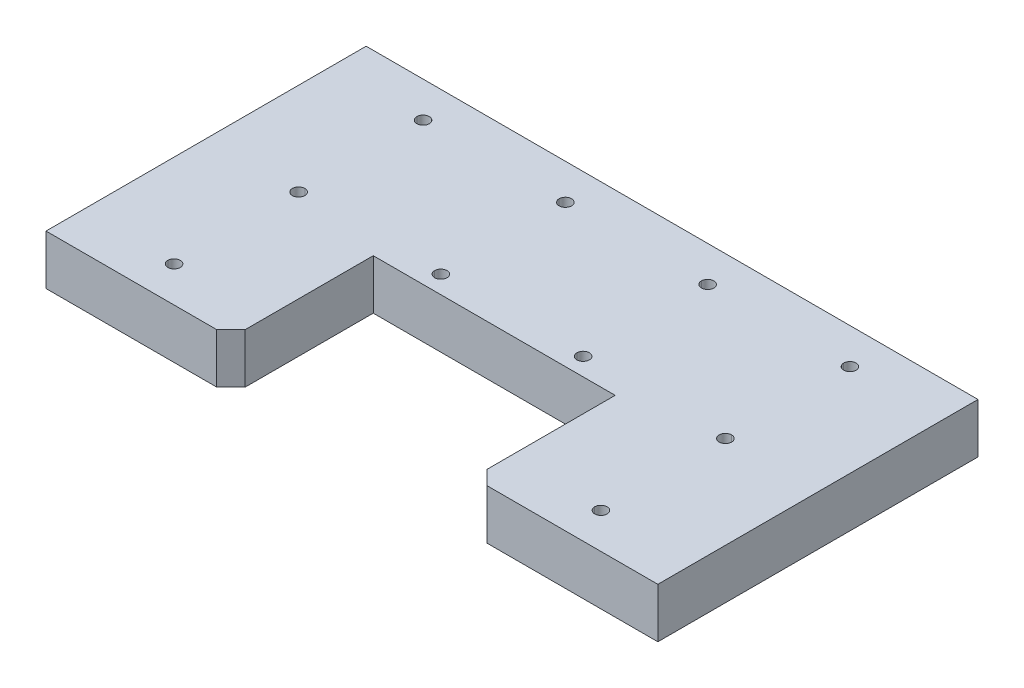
ISO-10303-21;
HEADER;
FILE_DESCRIPTION(('STEP AP214'),'2;1');
FILE_NAME('part.step','',(''),(''),'','','');
FILE_SCHEMA(('AUTOMOTIVE_DESIGN { 1 0 10303 214 1 1 1 1 }'));
ENDSEC;
DATA;
#1=APPLICATION_CONTEXT('core data for automotive mechanical design processes');
#2=APPLICATION_PROTOCOL_DEFINITION('international standard','automotive_design',2000,#1);
#3=PRODUCT_CONTEXT('',#1,'mechanical');
#4=PRODUCT('Part','Part','',(#3));
#5=PRODUCT_RELATED_PRODUCT_CATEGORY('part','',(#4));
#6=PRODUCT_DEFINITION_FORMATION('','',#4);
#7=PRODUCT_DEFINITION_CONTEXT('part definition',#1,'design');
#8=PRODUCT_DEFINITION('design','',#6,#7);
#9=PRODUCT_DEFINITION_SHAPE('','',#8);
#10=(LENGTH_UNIT() NAMED_UNIT(*) SI_UNIT(.MILLI.,.METRE.));
#11=(NAMED_UNIT(*) PLANE_ANGLE_UNIT() SI_UNIT($,.RADIAN.));
#12=(NAMED_UNIT(*) SI_UNIT($,.STERADIAN.) SOLID_ANGLE_UNIT());
#13=UNCERTAINTY_MEASURE_WITH_UNIT(LENGTH_MEASURE(1.E-05),#10,'distance_accuracy_value','');
#14=(GEOMETRIC_REPRESENTATION_CONTEXT(3) GLOBAL_UNCERTAINTY_ASSIGNED_CONTEXT((#13)) GLOBAL_UNIT_ASSIGNED_CONTEXT((#10,
#11,#12)) REPRESENTATION_CONTEXT('',''));
#15=CARTESIAN_POINT('',(0.,0.,0.));
#16=DIRECTION('',(0.,0.,1.));
#17=DIRECTION('',(1.,0.,0.));
#18=AXIS2_PLACEMENT_3D('',#15,#16,#17);
#19=CARTESIAN_POINT('',(130.005274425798,-0.000271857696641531,-46.4500657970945));
#20=DIRECTION('',(-2.09112818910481E-06,-0.999999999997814,0.));
#21=DIRECTION('',(0.999999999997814,-2.09112818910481E-06,0.));
#22=AXIS2_PLACEMENT_3D('',#19,#20,#21);
#23=PLANE('',#22);
#24=DIRECTION('',(0.999999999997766,-2.09112818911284E-06,-3.09362309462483E-07));
#25=VECTOR('',#24,1.);
#26=CARTESIAN_POINT('',(130.005163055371,-0.00027185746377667,-226.45006579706));
#27=LINE('',#26,#25);
#28=CARTESIAN_POINT('',(130.005163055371,-0.000271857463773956,-226.45006579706));
#29=VERTEX_POINT('',#28);
#30=CARTESIAN_POINT('',(470.005163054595,-0.000982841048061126,-226.450170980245));
#31=VERTEX_POINT('',#30);
#32=EDGE_CURVE('E379',#29,#31,#27,.T.);
#33=ORIENTED_EDGE('',*,*,#32,.F.);
#34=DIRECTION('',(6.18724598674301E-07,-1.29383244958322E-12,0.999999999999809));
#35=VECTOR('',#34,1.);
#36=CARTESIAN_POINT('',(130.005274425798,-0.000271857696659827,-46.4500657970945));
#37=LINE('',#36,#35);
#38=CARTESIAN_POINT('',(130.005274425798,-0.000271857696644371,-46.4500657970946));
#39=VERTEX_POINT('',#38);
#40=EDGE_CURVE('E374',#39,#29,#37,.F.);
#41=ORIENTED_EDGE('',*,*,#40,.F.);
#42=DIRECTION('',(0.707106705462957,-1.47865076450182E-06,-0.707106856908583));
#43=VECTOR('',#42,1.);
#44=CARTESIAN_POINT('',(110.005286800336,-0.000230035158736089,-26.4500738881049));
#45=LINE('',#44,#43);
#46=CARTESIAN_POINT('',(110.005286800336,-0.000230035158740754,-26.4500738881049));
#47=VERTEX_POINT('',#46);
#48=EDGE_CURVE('E368',#47,#39,#45,.T.);
#49=ORIENTED_EDGE('',*,*,#48,.F.);
#50=DIRECTION('',(0.999999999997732,-2.09112818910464E-06,4.04550324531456E-07));
#51=VECTOR('',#50,1.);
#52=CARTESIAN_POINT('',(-129.994836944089,0.000271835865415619,-26.4501709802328));
#53=LINE('',#52,#51);
#54=CARTESIAN_POINT('',(-129.994836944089,0.000271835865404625,-26.4501709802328));
#55=VERTEX_POINT('',#54);
#56=EDGE_CURVE('E284',#55,#47,#53,.T.);
#57=ORIENTED_EDGE('',*,*,#56,.F.);
#58=DIRECTION('',(0.,0.,1.));
#59=VECTOR('',#58,1.);
#60=CARTESIAN_POINT('',(-129.99483694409,0.000271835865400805,-26.4501709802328));
#61=LINE('',#60,#59);
#62=CARTESIAN_POINT('',(-129.994836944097,0.000271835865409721,-476.450170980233));
#63=VERTEX_POINT('',#62);
#64=EDGE_CURVE('E410',#63,#55,#61,.T.);
#65=ORIENTED_EDGE('',*,*,#64,.F.);
#66=DIRECTION('',(-0.999999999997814,2.09112818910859E-06,0.));
#67=VECTOR('',#66,1.);
#68=CARTESIAN_POINT('',(730.005163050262,-0.00152653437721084,-476.450170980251));
#69=LINE('',#68,#67);
#70=CARTESIAN_POINT('',(730.005163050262,-0.00152653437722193,-476.450170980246));
#71=VERTEX_POINT('',#70);
#72=EDGE_CURVE('E405',#71,#63,#69,.T.);
#73=ORIENTED_EDGE('',*,*,#72,.F.);
#74=DIRECTION('',(0.,0.,1.));
#75=VECTOR('',#74,1.);
#76=CARTESIAN_POINT('',(730.005163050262,-0.00152653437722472,-476.450170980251));
#77=LINE('',#76,#75);
#78=CARTESIAN_POINT('',(730.005163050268,-0.00152653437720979,-26.450170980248));
#79=VERTEX_POINT('',#78);
#80=EDGE_CURVE('E400',#79,#71,#77,.F.);
#81=ORIENTED_EDGE('',*,*,#80,.F.);
#82=DIRECTION('',(0.999999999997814,-2.09112818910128E-06,0.));
#83=VECTOR('',#82,1.);
#84=CARTESIAN_POINT('',(490.005163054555,-0.0010246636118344,-26.4501709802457));
#85=LINE('',#84,#83);
#86=CARTESIAN_POINT('',(490.005163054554,-0.00102466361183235,-26.4501709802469));
#87=VERTEX_POINT('',#86);
#88=EDGE_CURVE('E395',#87,#79,#85,.T.);
#89=ORIENTED_EDGE('',*,*,#88,.F.);
#90=DIRECTION('',(0.707106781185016,-1.47865092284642E-06,0.707106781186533));
#91=VECTOR('',#90,1.);
#92=CARTESIAN_POINT('',(470.005163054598,-0.000982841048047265,-46.4501709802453));
#93=LINE('',#92,#91);
#94=CARTESIAN_POINT('',(470.005163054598,-0.000982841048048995,-46.4501709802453));
#95=VERTEX_POINT('',#94);
#96=EDGE_CURVE('E387',#95,#87,#93,.T.);
#97=ORIENTED_EDGE('',*,*,#96,.F.);
#98=DIRECTION('',(0.,0.,1.));
#99=VECTOR('',#98,1.);
#100=CARTESIAN_POINT('',(470.005163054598,-0.000982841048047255,-46.4501709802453));
#101=LINE('',#100,#99);
#102=EDGE_CURVE('E384',#31,#95,#101,.T.);
#103=ORIENTED_EDGE('',*,*,#102,.F.);
#104=EDGE_LOOP('',(#33,#41,#49,#57,#65,#73,#81,#89,#97,#103));
#105=FACE_BOUND('',#104,.T.);
#106=CARTESIAN_POINT('',(400.005163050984,-0.00083646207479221,-426.450170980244));
#107=DIRECTION('',(2.09112818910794E-06,0.999999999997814,0.));
#108=DIRECTION('',(-0.999999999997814,2.09112818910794E-06,0.));
#109=AXIS2_PLACEMENT_3D('',#106,#107,#108);
#110=CIRCLE('',#109,8.75);
#111=CARTESIAN_POINT('',(408.755163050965,-0.000854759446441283,-426.450170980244));
#112=VERTEX_POINT('',#111);
#113=CARTESIAN_POINT('',(391.255163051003,-0.000818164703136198,-426.450170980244));
#114=VERTEX_POINT('',#113);
#115=EDGE_CURVE('E276',#112,#114,#110,.T.);
#116=ORIENTED_EDGE('',*,*,#115,.T.);
#117=CARTESIAN_POINT('',(400.005163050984,-0.000836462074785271,-426.450170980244));
#118=DIRECTION('',(2.09112818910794E-06,0.999999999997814,0.));
#119=DIRECTION('',(-0.999999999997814,2.09112818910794E-06,0.));
#120=AXIS2_PLACEMENT_3D('',#117,#118,#119);
#121=CIRCLE('',#120,8.75);
#122=EDGE_CURVE('E278',#114,#112,#121,.T.);
#123=ORIENTED_EDGE('',*,*,#122,.T.);
#124=EDGE_LOOP('',(#116,#123));
#125=FACE_BOUND('',#124,.T.);
#126=CARTESIAN_POINT('',(400.005163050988,-0.000836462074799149,-251.450170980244));
#127=DIRECTION('',(2.09112818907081E-06,0.999999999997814,0.));
#128=DIRECTION('',(-0.999999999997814,2.09112818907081E-06,0.));
#129=AXIS2_PLACEMENT_3D('',#126,#127,#128);
#130=CIRCLE('',#129,8.75);
#131=CARTESIAN_POINT('',(391.255163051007,-0.000818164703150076,-251.450170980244));
#132=VERTEX_POINT('',#131);
#133=CARTESIAN_POINT('',(408.755163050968,-0.000854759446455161,-251.450173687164));
#134=VERTEX_POINT('',#133);
#135=EDGE_CURVE('E270',#132,#134,#130,.T.);
#136=ORIENTED_EDGE('',*,*,#135,.T.);
#137=CARTESIAN_POINT('',(400.005163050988,-0.000836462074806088,-251.450170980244));
#138=DIRECTION('',(2.09112818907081E-06,0.999999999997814,0.));
#139=DIRECTION('',(-0.999999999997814,2.09112818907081E-06,0.));
#140=AXIS2_PLACEMENT_3D('',#137,#138,#139);
#141=CIRCLE('',#140,8.75);
#142=EDGE_CURVE('E272',#134,#132,#141,.T.);
#143=ORIENTED_EDGE('',*,*,#142,.T.);
#144=EDGE_LOOP('',(#136,#143));
#145=FACE_BOUND('',#144,.T.);
#146=CARTESIAN_POINT('',(600.00516305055,-0.00125468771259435,-251.450170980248));
#147=DIRECTION('',(2.09112818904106E-06,0.999999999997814,0.));
#148=DIRECTION('',(-0.999999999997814,2.09112818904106E-06,0.));
#149=AXIS2_PLACEMENT_3D('',#146,#147,#148);
#150=CIRCLE('',#149,8.75);
#151=CARTESIAN_POINT('',(600.00516305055,-0.00125468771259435,-242.700170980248));
#152=VERTEX_POINT('',#151);
#153=CARTESIAN_POINT('',(600.00516305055,-0.00125468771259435,-260.200170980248));
#154=VERTEX_POINT('',#153);
#155=EDGE_CURVE('E264',#152,#154,#150,.T.);
#156=ORIENTED_EDGE('',*,*,#155,.T.);
#157=CARTESIAN_POINT('',(600.00516305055,-0.00125468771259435,-251.450170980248));
#158=DIRECTION('',(2.09112818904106E-06,0.999999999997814,0.));
#159=DIRECTION('',(-0.999999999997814,2.09112818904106E-06,0.));
#160=AXIS2_PLACEMENT_3D('',#157,#158,#159);
#161=CIRCLE('',#160,8.75);
#162=EDGE_CURVE('E266',#154,#152,#161,.T.);
#163=ORIENTED_EDGE('',*,*,#162,.T.);
#164=EDGE_LOOP('',(#156,#163));
#165=FACE_BOUND('',#164,.T.);
#166=CARTESIAN_POINT('',(600.005163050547,-0.00125468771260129,-426.450170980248));
#167=DIRECTION('',(2.09112818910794E-06,0.999999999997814,0.));
#168=DIRECTION('',(-0.999999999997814,2.09112818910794E-06,0.));
#169=AXIS2_PLACEMENT_3D('',#166,#167,#168);
#170=CIRCLE('',#169,8.75);
#171=CARTESIAN_POINT('',(608.755163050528,-0.00127298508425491,-426.450170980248));
#172=VERTEX_POINT('',#171);
#173=CARTESIAN_POINT('',(591.255163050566,-0.00123639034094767,-426.450170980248));
#174=VERTEX_POINT('',#173);
#175=EDGE_CURVE('E258',#172,#174,#170,.T.);
#176=ORIENTED_EDGE('',*,*,#175,.T.);
#177=CARTESIAN_POINT('',(600.005163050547,-0.00125468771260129,-426.450170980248));
#178=DIRECTION('',(2.09112818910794E-06,0.999999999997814,0.));
#179=DIRECTION('',(-0.999999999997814,2.09112818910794E-06,0.));
#180=AXIS2_PLACEMENT_3D('',#177,#178,#179);
#181=CIRCLE('',#180,8.75);
#182=EDGE_CURVE('E260',#174,#172,#181,.T.);
#183=ORIENTED_EDGE('',*,*,#182,.T.);
#184=EDGE_LOOP('',(#176,#183));
#185=FACE_BOUND('',#184,.T.);
#186=CARTESIAN_POINT('',(600.005163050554,-0.0012546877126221,-76.4501709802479));
#187=DIRECTION('',(2.09112818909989E-06,0.999999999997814,0.));
#188=DIRECTION('',(-0.999999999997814,2.09112818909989E-06,0.));
#189=AXIS2_PLACEMENT_3D('',#186,#187,#188);
#190=CIRCLE('',#189,8.75);
#191=CARTESIAN_POINT('',(591.255163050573,-0.00123639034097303,-76.4501709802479));
#192=VERTEX_POINT('',#191);
#193=CARTESIAN_POINT('',(608.755163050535,-0.00127298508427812,-76.4501709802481));
#194=VERTEX_POINT('',#193);
#195=EDGE_CURVE('E252',#192,#194,#190,.T.);
#196=ORIENTED_EDGE('',*,*,#195,.T.);
#197=CARTESIAN_POINT('',(600.005163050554,-0.00125468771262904,-76.4501709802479));
#198=DIRECTION('',(2.09112818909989E-06,0.999999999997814,0.));
#199=DIRECTION('',(-0.999999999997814,2.09112818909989E-06,0.));
#200=AXIS2_PLACEMENT_3D('',#197,#198,#199);
#201=CIRCLE('',#200,8.75);
#202=EDGE_CURVE('E254',#194,#192,#201,.T.);
#203=ORIENTED_EDGE('',*,*,#202,.T.);
#204=EDGE_LOOP('',(#196,#203));
#205=FACE_BOUND('',#204,.T.);
#206=CARTESIAN_POINT('',(200.005163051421,-0.000418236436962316,-426.45017098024));
#207=DIRECTION('',(2.09112818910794E-06,0.999999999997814,0.));
#208=DIRECTION('',(-0.999999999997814,2.09112818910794E-06,0.));
#209=AXIS2_PLACEMENT_3D('',#206,#207,#208);
#210=CIRCLE('',#209,8.75);
#211=CARTESIAN_POINT('',(208.755163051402,-0.000436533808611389,-426.45017098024));
#212=VERTEX_POINT('',#211);
#213=CARTESIAN_POINT('',(191.255163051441,-0.000399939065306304,-426.45017098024));
#214=VERTEX_POINT('',#213);
#215=EDGE_CURVE('E246',#212,#214,#210,.T.);
#216=ORIENTED_EDGE('',*,*,#215,.T.);
#217=CARTESIAN_POINT('',(200.005163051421,-0.000418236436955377,-426.45017098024));
#218=DIRECTION('',(2.09112818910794E-06,0.999999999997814,0.));
#219=DIRECTION('',(-0.999999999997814,2.09112818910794E-06,0.));
#220=AXIS2_PLACEMENT_3D('',#217,#218,#219);
#221=CIRCLE('',#220,8.75);
#222=EDGE_CURVE('E248',#214,#212,#221,.T.);
#223=ORIENTED_EDGE('',*,*,#222,.T.);
#224=EDGE_LOOP('',(#216,#223));
#225=FACE_BOUND('',#224,.T.);
#226=CARTESIAN_POINT('',(200.005163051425,-0.000418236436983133,-251.45017098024));
#227=DIRECTION('',(2.09112818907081E-06,0.999999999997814,0.));
#228=DIRECTION('',(-0.999999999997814,2.09112818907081E-06,0.));
#229=AXIS2_PLACEMENT_3D('',#226,#227,#228);
#230=CIRCLE('',#229,8.75);
#231=CARTESIAN_POINT('',(191.255163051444,-0.00039993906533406,-251.45017098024));
#232=VERTEX_POINT('',#231);
#233=CARTESIAN_POINT('',(208.755163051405,-0.000436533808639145,-251.45017368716));
#234=VERTEX_POINT('',#233);
#235=EDGE_CURVE('E240',#232,#234,#230,.T.);
#236=ORIENTED_EDGE('',*,*,#235,.T.);
#237=CARTESIAN_POINT('',(200.005163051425,-0.000418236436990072,-251.45017098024));
#238=DIRECTION('',(2.09112818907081E-06,0.999999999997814,0.));
#239=DIRECTION('',(-0.999999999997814,2.09112818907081E-06,0.));
#240=AXIS2_PLACEMENT_3D('',#237,#238,#239);
#241=CIRCLE('',#240,8.75);
#242=EDGE_CURVE('E242',#234,#232,#241,.T.);
#243=ORIENTED_EDGE('',*,*,#242,.T.);
#244=EDGE_LOOP('',(#236,#243));
#245=FACE_BOUND('',#244,.T.);
#246=CARTESIAN_POINT('',(0.00516305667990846,-1.07991532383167E-08,-426.450170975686));
#247=DIRECTION('',(2.09112818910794E-06,0.999999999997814,0.));
#248=DIRECTION('',(-0.999999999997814,2.09112818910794E-06,0.));
#249=AXIS2_PLACEMENT_3D('',#246,#247,#248);
#250=CIRCLE('',#249,8.75);
#251=CARTESIAN_POINT('',(8.75516305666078,-1.83081708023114E-05,-426.450170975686));
#252=VERTEX_POINT('',#251);
#253=CARTESIAN_POINT('',(-8.74483694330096,1.82865725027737E-05,-426.450170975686));
#254=VERTEX_POINT('',#253);
#255=EDGE_CURVE('E234',#252,#254,#250,.T.);
#256=ORIENTED_EDGE('',*,*,#255,.T.);
#257=CARTESIAN_POINT('',(0.00516305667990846,-1.07991462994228E-08,-426.450170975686));
#258=DIRECTION('',(2.09112818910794E-06,0.999999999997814,0.));
#259=DIRECTION('',(-0.999999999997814,2.09112818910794E-06,0.));
#260=AXIS2_PLACEMENT_3D('',#257,#258,#259);
#261=CIRCLE('',#260,8.75);
#262=EDGE_CURVE('E236',#254,#252,#261,.T.);
#263=ORIENTED_EDGE('',*,*,#262,.T.);
#264=EDGE_LOOP('',(#256,#263));
#265=FACE_BOUND('',#264,.T.);
#266=CARTESIAN_POINT('',(0.00516305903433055,-1.07991671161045E-08,-251.450170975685));
#267=DIRECTION('',(2.09112818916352E-06,0.999999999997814,0.));
#268=DIRECTION('',(-0.999999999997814,2.09112818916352E-06,0.));
#269=AXIS2_PLACEMENT_3D('',#266,#267,#268);
#270=CIRCLE('',#269,8.75);
#271=CARTESIAN_POINT('',(0.00516305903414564,-1.07991671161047E-08,-260.200170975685));
#272=VERTEX_POINT('',#271);
#273=CARTESIAN_POINT('',(0.00516305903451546,-1.07991671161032E-08,-242.700170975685));
#274=VERTEX_POINT('',#273);
#275=EDGE_CURVE('E224',#272,#274,#270,.T.);
#276=ORIENTED_EDGE('',*,*,#275,.T.);
#277=CARTESIAN_POINT('',(0.00516305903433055,-1.07991671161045E-08,-251.450170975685));
#278=DIRECTION('',(2.09112818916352E-06,0.999999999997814,0.));
#279=DIRECTION('',(-0.999999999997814,2.09112818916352E-06,0.));
#280=AXIS2_PLACEMENT_3D('',#277,#278,#279);
#281=CIRCLE('',#280,8.75);
#282=EDGE_CURVE('E231',#274,#272,#281,.T.);
#283=ORIENTED_EDGE('',*,*,#282,.T.);
#284=EDGE_LOOP('',(#276,#283));
#285=FACE_BOUND('',#284,.T.);
#286=CARTESIAN_POINT('',(0.00516306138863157,-1.07991809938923E-08,-76.4501709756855));
#287=DIRECTION('',(2.09112818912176E-06,0.999999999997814,0.));
#288=DIRECTION('',(-0.999999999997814,2.09112818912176E-06,0.));
#289=AXIS2_PLACEMENT_3D('',#286,#287,#288);
#290=CIRCLE('',#289,8.75);
#291=CARTESIAN_POINT('',(-8.74483693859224,1.82865724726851E-05,-76.4501709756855));
#292=VERTEX_POINT('',#291);
#293=CARTESIAN_POINT('',(8.75516306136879,-1.83081708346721E-05,-76.4501674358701));
#294=VERTEX_POINT('',#293);
#295=EDGE_CURVE('E20',#292,#294,#290,.T.);
#296=ORIENTED_EDGE('',*,*,#295,.T.);
#297=CARTESIAN_POINT('',(0.00516306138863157,-1.07991809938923E-08,-76.4501709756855));
#298=DIRECTION('',(2.09112818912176E-06,0.999999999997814,0.));
#299=DIRECTION('',(-0.999999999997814,2.09112818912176E-06,0.));
#300=AXIS2_PLACEMENT_3D('',#297,#298,#299);
#301=CIRCLE('',#300,8.75);
#302=EDGE_CURVE('E211',#294,#292,#301,.T.);
#303=ORIENTED_EDGE('',*,*,#302,.T.);
#304=EDGE_LOOP('',(#296,#303));
#305=FACE_BOUND('',#304,.T.);
#306=ADVANCED_FACE('F17',(#105,#125,#145,#165,#185,#205,#225,#245,#265,#285,#305),#23,.T.);
#307=CARTESIAN_POINT('',(0.00523468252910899,34.249999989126,-76.4501709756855));
#308=DIRECTION('',(2.09112818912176E-06,0.999999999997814,0.));
#309=DIRECTION('',(-0.999999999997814,2.09112818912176E-06,0.));
#310=AXIS2_PLACEMENT_3D('',#307,#308,#309);
#311=CYLINDRICAL_SURFACE('',#310,8.75);
#312=ORIENTED_EDGE('',*,*,#295,.F.);
#313=DIRECTION('',(2.09112818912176E-06,0.999999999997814,0.));
#314=VECTOR('',#313,1.);
#315=CARTESIAN_POINT('',(-8.74476531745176,34.2500182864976,-76.4501709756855));
#316=LINE('',#315,#314);
#317=CARTESIAN_POINT('',(-8.744690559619,70.0000182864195,-76.4501709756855));
#318=VERTEX_POINT('',#317);
#319=EDGE_CURVE('E225',#292,#318,#316,.T.);
#320=ORIENTED_EDGE('',*,*,#319,.T.);
#321=CARTESIAN_POINT('',(0.00530944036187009,69.9999999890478,-76.4501709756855));
#322=DIRECTION('',(2.09112818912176E-06,0.999999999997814,0.));
#323=DIRECTION('',(-0.999999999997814,2.09112818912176E-06,0.));
#324=AXIS2_PLACEMENT_3D('',#321,#322,#323);
#325=CIRCLE('',#324,8.75);
#326=CARTESIAN_POINT('',(8.75530944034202,69.9999816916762,-76.4501674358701));
#327=VERTEX_POINT('',#326);
#328=EDGE_CURVE('E220',#327,#318,#325,.F.);
#329=ORIENTED_EDGE('',*,*,#328,.F.);
#330=DIRECTION('',(2.09112818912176E-06,0.999999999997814,0.));
#331=VECTOR('',#330,1.);
#332=CARTESIAN_POINT('',(8.75523468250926,34.2499816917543,-76.4501674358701));
#333=LINE('',#332,#331);
#334=EDGE_CURVE('E217',#327,#294,#333,.F.);
#335=ORIENTED_EDGE('',*,*,#334,.T.);
#336=EDGE_LOOP('',(#312,#320,#329,#335));
#337=FACE_BOUND('',#336,.T.);
#338=ADVANCED_FACE('F218',(#337),#311,.F.);
#339=CARTESIAN_POINT('',(0.00523468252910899,34.249999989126,-76.4501709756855));
#340=DIRECTION('',(2.09112818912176E-06,0.999999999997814,0.));
#341=DIRECTION('',(-0.999999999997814,2.09112818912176E-06,0.));
#342=AXIS2_PLACEMENT_3D('',#339,#340,#341);
#343=CYLINDRICAL_SURFACE('',#342,8.75);
#344=CARTESIAN_POINT('',(0.00530944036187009,69.9999999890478,-76.4501709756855));
#345=DIRECTION('',(2.09112818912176E-06,0.999999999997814,0.));
#346=DIRECTION('',(-0.999999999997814,2.09112818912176E-06,0.));
#347=AXIS2_PLACEMENT_3D('',#344,#345,#346);
#348=CIRCLE('',#347,8.75);
#349=EDGE_CURVE('E283',#318,#327,#348,.F.);
#350=ORIENTED_EDGE('',*,*,#349,.F.);
#351=ORIENTED_EDGE('',*,*,#319,.F.);
#352=ORIENTED_EDGE('',*,*,#302,.F.);
#353=ORIENTED_EDGE('',*,*,#334,.F.);
#354=EDGE_LOOP('',(#350,#351,#352,#353));
#355=FACE_BOUND('',#354,.T.);
#356=ADVANCED_FACE('F227',(#355),#343,.F.);
#357=CARTESIAN_POINT('',(0.0052346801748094,34.249999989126,-251.450170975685));
#358=DIRECTION('',(2.09112818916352E-06,0.999999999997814,0.));
#359=DIRECTION('',(-0.999999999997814,2.09112818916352E-06,0.));
#360=AXIS2_PLACEMENT_3D('',#357,#358,#359);
#361=CYLINDRICAL_SURFACE('',#360,8.75);
#362=ORIENTED_EDGE('',*,*,#275,.F.);
#363=DIRECTION('',(2.09112818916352E-06,0.999999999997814,0.));
#364=VECTOR('',#363,1.);
#365=CARTESIAN_POINT('',(0.00523468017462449,34.249999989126,-260.200170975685));
#366=LINE('',#365,#364);
#367=CARTESIAN_POINT('',(0.00530943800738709,69.9999999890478,-260.200170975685));
#368=VERTEX_POINT('',#367);
#369=EDGE_CURVE('E233',#272,#368,#366,.T.);
#370=ORIENTED_EDGE('',*,*,#369,.T.);
#371=CARTESIAN_POINT('',(0.005309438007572,69.9999999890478,-251.450170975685));
#372=DIRECTION('',(2.09112818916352E-06,0.999999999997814,0.));
#373=DIRECTION('',(-0.999999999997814,2.09112818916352E-06,0.));
#374=AXIS2_PLACEMENT_3D('',#371,#372,#373);
#375=CIRCLE('',#374,8.75);
#376=CARTESIAN_POINT('',(0.00530943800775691,69.9999999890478,-242.700170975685));
#377=VERTEX_POINT('',#376);
#378=EDGE_CURVE('E286',#377,#368,#375,.F.);
#379=ORIENTED_EDGE('',*,*,#378,.F.);
#380=DIRECTION('',(2.09112818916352E-06,0.999999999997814,0.));
#381=VECTOR('',#380,1.);
#382=CARTESIAN_POINT('',(0.00523468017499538,34.249999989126,-242.700170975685));
#383=LINE('',#382,#381);
#384=EDGE_CURVE('E237',#377,#274,#383,.F.);
#385=ORIENTED_EDGE('',*,*,#384,.T.);
#386=EDGE_LOOP('',(#362,#370,#379,#385));
#387=FACE_BOUND('',#386,.T.);
#388=ADVANCED_FACE('F688',(#387),#361,.F.);
#389=CARTESIAN_POINT('',(0.0052346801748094,34.249999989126,-251.450170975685));
#390=DIRECTION('',(2.09112818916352E-06,0.999999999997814,0.));
#391=DIRECTION('',(-0.999999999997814,2.09112818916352E-06,0.));
#392=AXIS2_PLACEMENT_3D('',#389,#390,#391);
#393=CYLINDRICAL_SURFACE('',#392,8.75);
#394=CARTESIAN_POINT('',(0.005309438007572,69.9999999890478,-251.450170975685));
#395=DIRECTION('',(2.09112818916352E-06,0.999999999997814,0.));
#396=DIRECTION('',(-0.999999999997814,2.09112818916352E-06,0.));
#397=AXIS2_PLACEMENT_3D('',#394,#395,#396);
#398=CIRCLE('',#397,8.75);
#399=EDGE_CURVE('E289',#368,#377,#398,.F.);
#400=ORIENTED_EDGE('',*,*,#399,.F.);
#401=ORIENTED_EDGE('',*,*,#369,.F.);
#402=ORIENTED_EDGE('',*,*,#282,.F.);
#403=ORIENTED_EDGE('',*,*,#384,.F.);
#404=EDGE_LOOP('',(#400,#401,#402,#403));
#405=FACE_BOUND('',#404,.T.);
#406=ADVANCED_FACE('F680',(#405),#393,.F.);
#407=CARTESIAN_POINT('',(0.0052346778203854,34.249999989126,-426.450170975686));
#408=DIRECTION('',(2.09112818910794E-06,0.999999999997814,0.));
#409=DIRECTION('',(-0.999999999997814,2.09112818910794E-06,0.));
#410=AXIS2_PLACEMENT_3D('',#407,#408,#409);
#411=CYLINDRICAL_SURFACE('',#410,8.75);
#412=ORIENTED_EDGE('',*,*,#255,.F.);
#413=DIRECTION('',(2.09112818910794E-06,0.999999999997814,0.));
#414=VECTOR('',#413,1.);
#415=CARTESIAN_POINT('',(8.75523467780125,34.2499816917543,-426.450170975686));
#416=LINE('',#415,#414);
#417=CARTESIAN_POINT('',(8.75530943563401,69.9999816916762,-426.450170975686));
#418=VERTEX_POINT('',#417);
#419=EDGE_CURVE('E239',#252,#418,#416,.T.);
#420=ORIENTED_EDGE('',*,*,#419,.T.);
#421=CARTESIAN_POINT('',(0.00530943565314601,69.9999999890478,-426.450170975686));
#422=DIRECTION('',(2.09112818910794E-06,0.999999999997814,0.));
#423=DIRECTION('',(-0.999999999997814,2.09112818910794E-06,0.));
#424=AXIS2_PLACEMENT_3D('',#421,#422,#423);
#425=CIRCLE('',#424,8.75);
#426=CARTESIAN_POINT('',(-8.74469056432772,70.0000182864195,-426.450170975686));
#427=VERTEX_POINT('',#426);
#428=EDGE_CURVE('E292',#427,#418,#425,.F.);
#429=ORIENTED_EDGE('',*,*,#428,.F.);
#430=DIRECTION('',(2.09112818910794E-06,0.999999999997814,0.));
#431=VECTOR('',#430,1.);
#432=CARTESIAN_POINT('',(-8.74476532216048,34.2500182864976,-426.450170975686));
#433=LINE('',#432,#431);
#434=EDGE_CURVE('E243',#427,#254,#433,.F.);
#435=ORIENTED_EDGE('',*,*,#434,.T.);
#436=EDGE_LOOP('',(#412,#420,#429,#435));
#437=FACE_BOUND('',#436,.T.);
#438=ADVANCED_FACE('F672',(#437),#411,.F.);
#439=CARTESIAN_POINT('',(0.0052346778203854,34.249999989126,-426.450170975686));
#440=DIRECTION('',(2.09112818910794E-06,0.999999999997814,0.));
#441=DIRECTION('',(-0.999999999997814,2.09112818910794E-06,0.));
#442=AXIS2_PLACEMENT_3D('',#439,#440,#441);
#443=CYLINDRICAL_SURFACE('',#442,8.75);
#444=CARTESIAN_POINT('',(0.00530943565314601,69.9999999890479,-426.450170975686));
#445=DIRECTION('',(2.09112818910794E-06,0.999999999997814,0.));
#446=DIRECTION('',(-0.999999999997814,2.09112818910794E-06,0.));
#447=AXIS2_PLACEMENT_3D('',#444,#445,#446);
#448=CIRCLE('',#447,8.75);
#449=EDGE_CURVE('E295',#418,#427,#448,.F.);
#450=ORIENTED_EDGE('',*,*,#449,.F.);
#451=ORIENTED_EDGE('',*,*,#419,.F.);
#452=ORIENTED_EDGE('',*,*,#262,.F.);
#453=ORIENTED_EDGE('',*,*,#434,.F.);
#454=EDGE_LOOP('',(#450,#451,#452,#453));
#455=FACE_BOUND('',#454,.T.);
#456=ADVANCED_FACE('F664',(#455),#443,.F.);
#457=CARTESIAN_POINT('',(200.005234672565,34.2495817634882,-251.45017098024));
#458=DIRECTION('',(2.09112818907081E-06,0.999999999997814,0.));
#459=DIRECTION('',(-0.999999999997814,2.09112818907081E-06,0.));
#460=AXIS2_PLACEMENT_3D('',#457,#458,#459);
#461=CYLINDRICAL_SURFACE('',#460,8.75);
#462=ORIENTED_EDGE('',*,*,#235,.F.);
#463=DIRECTION('',(2.09112818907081E-06,0.999999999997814,0.));
#464=VECTOR('',#463,1.);
#465=CARTESIAN_POINT('',(191.255234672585,34.2496000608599,-251.45017098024));
#466=LINE('',#465,#464);
#467=CARTESIAN_POINT('',(191.255309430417,69.9996000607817,-251.45017098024));
#468=VERTEX_POINT('',#467);
#469=EDGE_CURVE('E245',#232,#468,#466,.T.);
#470=ORIENTED_EDGE('',*,*,#469,.T.);
#471=CARTESIAN_POINT('',(200.005309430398,69.99958176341,-251.45017098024));
#472=DIRECTION('',(2.09112818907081E-06,0.999999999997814,0.));
#473=DIRECTION('',(-0.999999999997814,2.09112818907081E-06,0.));
#474=AXIS2_PLACEMENT_3D('',#471,#472,#473);
#475=CIRCLE('',#474,8.75);
#476=CARTESIAN_POINT('',(208.755309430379,69.9995634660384,-251.45017368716));
#477=VERTEX_POINT('',#476);
#478=EDGE_CURVE('E298',#477,#468,#475,.F.);
#479=ORIENTED_EDGE('',*,*,#478,.F.);
#480=DIRECTION('',(2.09112818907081E-06,0.999999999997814,0.));
#481=VECTOR('',#480,1.);
#482=CARTESIAN_POINT('',(208.755234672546,34.2495634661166,-251.45017368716));
#483=LINE('',#482,#481);
#484=EDGE_CURVE('E249',#477,#234,#483,.F.);
#485=ORIENTED_EDGE('',*,*,#484,.T.);
#486=EDGE_LOOP('',(#462,#470,#479,#485));
#487=FACE_BOUND('',#486,.T.);
#488=ADVANCED_FACE('F656',(#487),#461,.F.);
#489=CARTESIAN_POINT('',(200.005234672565,34.2495817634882,-251.45017098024));
#490=DIRECTION('',(2.09112818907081E-06,0.999999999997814,0.));
#491=DIRECTION('',(-0.999999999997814,2.09112818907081E-06,0.));
#492=AXIS2_PLACEMENT_3D('',#489,#490,#491);
#493=CYLINDRICAL_SURFACE('',#492,8.75);
#494=CARTESIAN_POINT('',(200.005309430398,69.99958176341,-251.45017098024));
#495=DIRECTION('',(2.09112818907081E-06,0.999999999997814,0.));
#496=DIRECTION('',(-0.999999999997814,2.09112818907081E-06,0.));
#497=AXIS2_PLACEMENT_3D('',#494,#495,#496);
#498=CIRCLE('',#497,8.75);
#499=EDGE_CURVE('E301',#468,#477,#498,.F.);
#500=ORIENTED_EDGE('',*,*,#499,.F.);
#501=ORIENTED_EDGE('',*,*,#469,.F.);
#502=ORIENTED_EDGE('',*,*,#242,.F.);
#503=ORIENTED_EDGE('',*,*,#484,.F.);
#504=EDGE_LOOP('',(#500,#501,#502,#503));
#505=FACE_BOUND('',#504,.T.);
#506=ADVANCED_FACE('F648',(#505),#493,.F.);
#507=CARTESIAN_POINT('',(200.005234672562,34.2495817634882,-426.45017098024));
#508=DIRECTION('',(2.09112818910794E-06,0.999999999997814,0.));
#509=DIRECTION('',(-0.999999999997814,2.09112818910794E-06,0.));
#510=AXIS2_PLACEMENT_3D('',#507,#508,#509);
#511=CYLINDRICAL_SURFACE('',#510,8.75);
#512=ORIENTED_EDGE('',*,*,#215,.F.);
#513=DIRECTION('',(2.09112818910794E-06,0.999999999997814,0.));
#514=VECTOR('',#513,1.);
#515=CARTESIAN_POINT('',(208.755234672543,34.2495634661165,-426.45017098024));
#516=LINE('',#515,#514);
#517=CARTESIAN_POINT('',(208.755309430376,69.9995634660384,-426.45017098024));
#518=VERTEX_POINT('',#517);
#519=EDGE_CURVE('E251',#212,#518,#516,.T.);
#520=ORIENTED_EDGE('',*,*,#519,.T.);
#521=CARTESIAN_POINT('',(200.005309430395,69.99958176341,-426.45017098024));
#522=DIRECTION('',(2.09112818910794E-06,0.999999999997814,0.));
#523=DIRECTION('',(-0.999999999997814,2.09112818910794E-06,0.));
#524=AXIS2_PLACEMENT_3D('',#521,#522,#523);
#525=CIRCLE('',#524,8.75);
#526=CARTESIAN_POINT('',(191.255309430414,69.9996000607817,-426.45017098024));
#527=VERTEX_POINT('',#526);
#528=EDGE_CURVE('E304',#527,#518,#525,.F.);
#529=ORIENTED_EDGE('',*,*,#528,.F.);
#530=DIRECTION('',(2.09112818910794E-06,0.999999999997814,0.));
#531=VECTOR('',#530,1.);
#532=CARTESIAN_POINT('',(191.255234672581,34.2496000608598,-426.45017098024));
#533=LINE('',#532,#531);
#534=EDGE_CURVE('E255',#527,#214,#533,.F.);
#535=ORIENTED_EDGE('',*,*,#534,.T.);
#536=EDGE_LOOP('',(#512,#520,#529,#535));
#537=FACE_BOUND('',#536,.T.);
#538=ADVANCED_FACE('F640',(#537),#511,.F.);
#539=CARTESIAN_POINT('',(200.005234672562,34.2495817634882,-426.45017098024));
#540=DIRECTION('',(2.09112818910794E-06,0.999999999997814,0.));
#541=DIRECTION('',(-0.999999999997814,2.09112818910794E-06,0.));
#542=AXIS2_PLACEMENT_3D('',#539,#540,#541);
#543=CYLINDRICAL_SURFACE('',#542,8.75);
#544=CARTESIAN_POINT('',(200.005309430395,69.99958176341,-426.45017098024));
#545=DIRECTION('',(2.09112818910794E-06,0.999999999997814,0.));
#546=DIRECTION('',(-0.999999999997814,2.09112818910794E-06,0.));
#547=AXIS2_PLACEMENT_3D('',#544,#545,#546);
#548=CIRCLE('',#547,8.75);
#549=EDGE_CURVE('E307',#518,#527,#548,.F.);
#550=ORIENTED_EDGE('',*,*,#549,.F.);
#551=ORIENTED_EDGE('',*,*,#519,.F.);
#552=ORIENTED_EDGE('',*,*,#222,.F.);
#553=ORIENTED_EDGE('',*,*,#534,.F.);
#554=EDGE_LOOP('',(#550,#551,#552,#553));
#555=FACE_BOUND('',#554,.T.);
#556=ADVANCED_FACE('F632',(#555),#543,.F.);
#557=CARTESIAN_POINT('',(600.005234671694,34.2487453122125,-76.4501709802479));
#558=DIRECTION('',(2.09112818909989E-06,0.999999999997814,0.));
#559=DIRECTION('',(-0.999999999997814,2.09112818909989E-06,0.));
#560=AXIS2_PLACEMENT_3D('',#557,#558,#559);
#561=CYLINDRICAL_SURFACE('',#560,8.75);
#562=ORIENTED_EDGE('',*,*,#195,.F.);
#563=DIRECTION('',(2.09112818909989E-06,0.999999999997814,0.));
#564=VECTOR('',#563,1.);
#565=CARTESIAN_POINT('',(591.255234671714,34.2487636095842,-76.4501709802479));
#566=LINE('',#565,#564);
#567=CARTESIAN_POINT('',(591.255309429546,69.998763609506,-76.4501709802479));
#568=VERTEX_POINT('',#567);
#569=EDGE_CURVE('E257',#192,#568,#566,.T.);
#570=ORIENTED_EDGE('',*,*,#569,.T.);
#571=CARTESIAN_POINT('',(600.005309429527,69.9987453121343,-76.4501709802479));
#572=DIRECTION('',(2.09112818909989E-06,0.999999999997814,0.));
#573=DIRECTION('',(-0.999999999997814,2.09112818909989E-06,0.));
#574=AXIS2_PLACEMENT_3D('',#571,#572,#573);
#575=CIRCLE('',#574,8.75);
#576=CARTESIAN_POINT('',(608.755309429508,69.9987270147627,-76.4501709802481));
#577=VERTEX_POINT('',#576);
#578=EDGE_CURVE('E310',#577,#568,#575,.F.);
#579=ORIENTED_EDGE('',*,*,#578,.F.);
#580=DIRECTION('',(2.09112818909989E-06,0.999999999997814,0.));
#581=VECTOR('',#580,1.);
#582=CARTESIAN_POINT('',(608.755234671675,34.2487270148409,-76.4501709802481));
#583=LINE('',#582,#581);
#584=EDGE_CURVE('E261',#577,#194,#583,.F.);
#585=ORIENTED_EDGE('',*,*,#584,.T.);
#586=EDGE_LOOP('',(#562,#570,#579,#585));
#587=FACE_BOUND('',#586,.T.);
#588=ADVANCED_FACE('F624',(#587),#561,.F.);
#589=CARTESIAN_POINT('',(600.005234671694,34.2487453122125,-76.4501709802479));
#590=DIRECTION('',(2.09112818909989E-06,0.999999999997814,0.));
#591=DIRECTION('',(-0.999999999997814,2.09112818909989E-06,0.));
#592=AXIS2_PLACEMENT_3D('',#589,#590,#591);
#593=CYLINDRICAL_SURFACE('',#592,8.75);
#594=CARTESIAN_POINT('',(600.005309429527,69.9987453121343,-76.4501709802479));
#595=DIRECTION('',(2.09112818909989E-06,0.999999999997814,0.));
#596=DIRECTION('',(-0.999999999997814,2.09112818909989E-06,0.));
#597=AXIS2_PLACEMENT_3D('',#594,#595,#596);
#598=CIRCLE('',#597,8.75);
#599=EDGE_CURVE('E313',#568,#577,#598,.F.);
#600=ORIENTED_EDGE('',*,*,#599,.F.);
#601=ORIENTED_EDGE('',*,*,#569,.F.);
#602=ORIENTED_EDGE('',*,*,#202,.F.);
#603=ORIENTED_EDGE('',*,*,#584,.F.);
#604=EDGE_LOOP('',(#600,#601,#602,#603));
#605=FACE_BOUND('',#604,.T.);
#606=ADVANCED_FACE('F616',(#605),#593,.F.);
#607=CARTESIAN_POINT('',(600.005234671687,34.2487453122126,-426.450170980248));
#608=DIRECTION('',(2.09112818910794E-06,0.999999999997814,0.));
#609=DIRECTION('',(-0.999999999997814,2.09112818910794E-06,0.));
#610=AXIS2_PLACEMENT_3D('',#607,#608,#609);
#611=CYLINDRICAL_SURFACE('',#610,8.75);
#612=ORIENTED_EDGE('',*,*,#175,.F.);
#613=DIRECTION('',(2.09112818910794E-06,0.999999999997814,0.));
#614=VECTOR('',#613,1.);
#615=CARTESIAN_POINT('',(608.755234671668,34.2487270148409,-426.450170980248));
#616=LINE('',#615,#614);
#617=CARTESIAN_POINT('',(608.755309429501,69.9987270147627,-426.450170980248));
#618=VERTEX_POINT('',#617);
#619=EDGE_CURVE('E263',#172,#618,#616,.T.);
#620=ORIENTED_EDGE('',*,*,#619,.T.);
#621=CARTESIAN_POINT('',(600.00530942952,69.9987453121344,-426.450170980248));
#622=DIRECTION('',(2.09112818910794E-06,0.999999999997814,0.));
#623=DIRECTION('',(-0.999999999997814,2.09112818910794E-06,0.));
#624=AXIS2_PLACEMENT_3D('',#621,#622,#623);
#625=CIRCLE('',#624,8.75);
#626=CARTESIAN_POINT('',(591.255309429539,69.998763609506,-426.450170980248));
#627=VERTEX_POINT('',#626);
#628=EDGE_CURVE('E316',#627,#618,#625,.F.);
#629=ORIENTED_EDGE('',*,*,#628,.F.);
#630=DIRECTION('',(2.09112818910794E-06,0.999999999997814,0.));
#631=VECTOR('',#630,1.);
#632=CARTESIAN_POINT('',(591.255234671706,34.2487636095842,-426.450170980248));
#633=LINE('',#632,#631);
#634=EDGE_CURVE('E267',#627,#174,#633,.F.);
#635=ORIENTED_EDGE('',*,*,#634,.T.);
#636=EDGE_LOOP('',(#612,#620,#629,#635));
#637=FACE_BOUND('',#636,.T.);
#638=ADVANCED_FACE('F608',(#637),#611,.F.);
#639=CARTESIAN_POINT('',(600.005234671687,34.2487453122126,-426.450170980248));
#640=DIRECTION('',(2.09112818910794E-06,0.999999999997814,0.));
#641=DIRECTION('',(-0.999999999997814,2.09112818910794E-06,0.));
#642=AXIS2_PLACEMENT_3D('',#639,#640,#641);
#643=CYLINDRICAL_SURFACE('',#642,8.75);
#644=CARTESIAN_POINT('',(600.00530942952,69.9987453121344,-426.450170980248));
#645=DIRECTION('',(2.09112818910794E-06,0.999999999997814,0.));
#646=DIRECTION('',(-0.999999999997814,2.09112818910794E-06,0.));
#647=AXIS2_PLACEMENT_3D('',#644,#645,#646);
#648=CIRCLE('',#647,8.75);
#649=EDGE_CURVE('E319',#618,#627,#648,.F.);
#650=ORIENTED_EDGE('',*,*,#649,.F.);
#651=ORIENTED_EDGE('',*,*,#619,.F.);
#652=ORIENTED_EDGE('',*,*,#182,.F.);
#653=ORIENTED_EDGE('',*,*,#634,.F.);
#654=EDGE_LOOP('',(#650,#651,#652,#653));
#655=FACE_BOUND('',#654,.T.);
#656=ADVANCED_FACE('F600',(#655),#643,.F.);
#657=CARTESIAN_POINT('',(600.005234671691,34.2487453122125,-251.450170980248));
#658=DIRECTION('',(2.09112818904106E-06,0.999999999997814,0.));
#659=DIRECTION('',(-0.999999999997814,2.09112818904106E-06,0.));
#660=AXIS2_PLACEMENT_3D('',#657,#658,#659);
#661=CYLINDRICAL_SURFACE('',#660,8.75);
#662=ORIENTED_EDGE('',*,*,#155,.F.);
#663=DIRECTION('',(2.09112818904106E-06,0.999999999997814,0.));
#664=VECTOR('',#663,1.);
#665=CARTESIAN_POINT('',(600.005234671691,34.2487453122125,-242.700170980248));
#666=LINE('',#665,#664);
#667=CARTESIAN_POINT('',(600.005309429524,69.9987453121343,-242.700170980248));
#668=VERTEX_POINT('',#667);
#669=EDGE_CURVE('E269',#152,#668,#666,.T.);
#670=ORIENTED_EDGE('',*,*,#669,.T.);
#671=CARTESIAN_POINT('',(600.005309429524,69.9987453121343,-251.450170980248));
#672=DIRECTION('',(2.09112818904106E-06,0.999999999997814,0.));
#673=DIRECTION('',(-0.999999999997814,2.09112818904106E-06,0.));
#674=AXIS2_PLACEMENT_3D('',#671,#672,#673);
#675=CIRCLE('',#674,8.75);
#676=CARTESIAN_POINT('',(600.005309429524,69.9987453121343,-260.200170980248));
#677=VERTEX_POINT('',#676);
#678=EDGE_CURVE('E322',#677,#668,#675,.F.);
#679=ORIENTED_EDGE('',*,*,#678,.F.);
#680=DIRECTION('',(2.09112818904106E-06,0.999999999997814,0.));
#681=VECTOR('',#680,1.);
#682=CARTESIAN_POINT('',(600.005234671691,34.2487453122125,-260.200170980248));
#683=LINE('',#682,#681);
#684=EDGE_CURVE('E273',#677,#154,#683,.F.);
#685=ORIENTED_EDGE('',*,*,#684,.T.);
#686=EDGE_LOOP('',(#662,#670,#679,#685));
#687=FACE_BOUND('',#686,.T.);
#688=ADVANCED_FACE('F592',(#687),#661,.F.);
#689=CARTESIAN_POINT('',(600.005234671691,34.2487453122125,-251.450170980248));
#690=DIRECTION('',(2.09112818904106E-06,0.999999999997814,0.));
#691=DIRECTION('',(-0.999999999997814,2.09112818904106E-06,0.));
#692=AXIS2_PLACEMENT_3D('',#689,#690,#691);
#693=CYLINDRICAL_SURFACE('',#692,8.75);
#694=CARTESIAN_POINT('',(600.005309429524,69.9987453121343,-251.450170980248));
#695=DIRECTION('',(2.09112818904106E-06,0.999999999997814,0.));
#696=DIRECTION('',(-0.999999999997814,2.09112818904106E-06,0.));
#697=AXIS2_PLACEMENT_3D('',#694,#695,#696);
#698=CIRCLE('',#697,8.75);
#699=EDGE_CURVE('E325',#668,#677,#698,.F.);
#700=ORIENTED_EDGE('',*,*,#699,.F.);
#701=ORIENTED_EDGE('',*,*,#669,.F.);
#702=ORIENTED_EDGE('',*,*,#162,.F.);
#703=ORIENTED_EDGE('',*,*,#684,.F.);
#704=EDGE_LOOP('',(#700,#701,#702,#703));
#705=FACE_BOUND('',#704,.T.);
#706=ADVANCED_FACE('F584',(#705),#693,.F.);
#707=CARTESIAN_POINT('',(400.005234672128,34.2491635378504,-251.450170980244));
#708=DIRECTION('',(2.09112818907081E-06,0.999999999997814,0.));
#709=DIRECTION('',(-0.999999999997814,2.09112818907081E-06,0.));
#710=AXIS2_PLACEMENT_3D('',#707,#708,#709);
#711=CYLINDRICAL_SURFACE('',#710,8.75);
#712=ORIENTED_EDGE('',*,*,#135,.F.);
#713=DIRECTION('',(2.09112818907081E-06,0.999999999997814,0.));
#714=VECTOR('',#713,1.);
#715=CARTESIAN_POINT('',(391.255234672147,34.249181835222,-251.450170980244));
#716=LINE('',#715,#714);
#717=CARTESIAN_POINT('',(391.25530942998,69.9991818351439,-251.450170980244));
#718=VERTEX_POINT('',#717);
#719=EDGE_CURVE('E275',#132,#718,#716,.T.);
#720=ORIENTED_EDGE('',*,*,#719,.T.);
#721=CARTESIAN_POINT('',(400.005309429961,69.9991635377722,-251.450170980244));
#722=DIRECTION('',(2.09112818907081E-06,0.999999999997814,0.));
#723=DIRECTION('',(-0.999999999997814,2.09112818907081E-06,0.));
#724=AXIS2_PLACEMENT_3D('',#721,#722,#723);
#725=CIRCLE('',#724,8.75);
#726=CARTESIAN_POINT('',(408.755309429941,69.9991452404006,-251.450173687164));
#727=VERTEX_POINT('',#726);
#728=EDGE_CURVE('E328',#727,#718,#725,.F.);
#729=ORIENTED_EDGE('',*,*,#728,.F.);
#730=DIRECTION('',(2.09112818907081E-06,0.999999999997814,0.));
#731=VECTOR('',#730,1.);
#732=CARTESIAN_POINT('',(408.755234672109,34.2491452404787,-251.450173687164));
#733=LINE('',#732,#731);
#734=EDGE_CURVE('E279',#727,#134,#733,.F.);
#735=ORIENTED_EDGE('',*,*,#734,.T.);
#736=EDGE_LOOP('',(#712,#720,#729,#735));
#737=FACE_BOUND('',#736,.T.);
#738=ADVANCED_FACE('F576',(#737),#711,.F.);
#739=CARTESIAN_POINT('',(400.005234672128,34.2491635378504,-251.450170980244));
#740=DIRECTION('',(2.09112818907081E-06,0.999999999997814,0.));
#741=DIRECTION('',(-0.999999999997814,2.09112818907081E-06,0.));
#742=AXIS2_PLACEMENT_3D('',#739,#740,#741);
#743=CYLINDRICAL_SURFACE('',#742,8.75);
#744=CARTESIAN_POINT('',(400.005309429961,69.9991635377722,-251.450170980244));
#745=DIRECTION('',(2.09112818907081E-06,0.999999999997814,0.));
#746=DIRECTION('',(-0.999999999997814,2.09112818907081E-06,0.));
#747=AXIS2_PLACEMENT_3D('',#744,#745,#746);
#748=CIRCLE('',#747,8.75);
#749=EDGE_CURVE('E331',#718,#727,#748,.F.);
#750=ORIENTED_EDGE('',*,*,#749,.F.);
#751=ORIENTED_EDGE('',*,*,#719,.F.);
#752=ORIENTED_EDGE('',*,*,#142,.F.);
#753=ORIENTED_EDGE('',*,*,#734,.F.);
#754=EDGE_LOOP('',(#750,#751,#752,#753));
#755=FACE_BOUND('',#754,.T.);
#756=ADVANCED_FACE('F568',(#755),#743,.F.);
#757=CARTESIAN_POINT('',(400.005234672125,34.2491635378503,-426.450170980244));
#758=DIRECTION('',(2.09112818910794E-06,0.999999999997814,0.));
#759=DIRECTION('',(-0.999999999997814,2.09112818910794E-06,0.));
#760=AXIS2_PLACEMENT_3D('',#757,#758,#759);
#761=CYLINDRICAL_SURFACE('',#760,8.75);
#762=ORIENTED_EDGE('',*,*,#115,.F.);
#763=DIRECTION('',(2.09112818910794E-06,0.999999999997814,0.));
#764=VECTOR('',#763,1.);
#765=CARTESIAN_POINT('',(408.755234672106,34.2491452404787,-426.450170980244));
#766=LINE('',#765,#764);
#767=CARTESIAN_POINT('',(408.755309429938,69.9991452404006,-426.450170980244));
#768=VERTEX_POINT('',#767);
#769=EDGE_CURVE('E281',#112,#768,#766,.T.);
#770=ORIENTED_EDGE('',*,*,#769,.T.);
#771=CARTESIAN_POINT('',(400.005309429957,69.9991635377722,-426.450170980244));
#772=DIRECTION('',(2.09112818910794E-06,0.999999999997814,0.));
#773=DIRECTION('',(-0.999999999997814,2.09112818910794E-06,0.));
#774=AXIS2_PLACEMENT_3D('',#771,#772,#773);
#775=CIRCLE('',#774,8.75);
#776=CARTESIAN_POINT('',(391.255309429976,69.9991818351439,-426.450170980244));
#777=VERTEX_POINT('',#776);
#778=EDGE_CURVE('E334',#777,#768,#775,.F.);
#779=ORIENTED_EDGE('',*,*,#778,.F.);
#780=DIRECTION('',(2.09112818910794E-06,0.999999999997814,0.));
#781=VECTOR('',#780,1.);
#782=CARTESIAN_POINT('',(391.255234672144,34.249181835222,-426.450170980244));
#783=LINE('',#782,#781);
#784=EDGE_CURVE('E365',#777,#114,#783,.F.);
#785=ORIENTED_EDGE('',*,*,#784,.T.);
#786=EDGE_LOOP('',(#762,#770,#779,#785));
#787=FACE_BOUND('',#786,.T.);
#788=ADVANCED_FACE('F560',(#787),#761,.F.);
#789=CARTESIAN_POINT('',(400.005234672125,34.2491635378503,-426.450170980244));
#790=DIRECTION('',(2.09112818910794E-06,0.999999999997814,0.));
#791=DIRECTION('',(-0.999999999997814,2.09112818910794E-06,0.));
#792=AXIS2_PLACEMENT_3D('',#789,#790,#791);
#793=CYLINDRICAL_SURFACE('',#792,8.75);
#794=CARTESIAN_POINT('',(400.005309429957,69.9991635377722,-426.450170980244));
#795=DIRECTION('',(2.09112818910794E-06,0.999999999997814,0.));
#796=DIRECTION('',(-0.999999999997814,2.09112818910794E-06,0.));
#797=AXIS2_PLACEMENT_3D('',#794,#795,#796);
#798=CIRCLE('',#797,8.75);
#799=EDGE_CURVE('E337',#768,#777,#798,.F.);
#800=ORIENTED_EDGE('',*,*,#799,.F.);
#801=ORIENTED_EDGE('',*,*,#769,.F.);
#802=ORIENTED_EDGE('',*,*,#122,.F.);
#803=ORIENTED_EDGE('',*,*,#784,.F.);
#804=EDGE_LOOP('',(#800,#801,#802,#803));
#805=FACE_BOUND('',#804,.T.);
#806=ADVANCED_FACE('F553',(#805),#793,.F.);
#807=CARTESIAN_POINT('',(110.005286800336,-0.000230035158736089,-26.4500738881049));
#808=DIRECTION('',(0.707106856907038,-1.47865108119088E-06,0.707106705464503));
#809=DIRECTION('',(0.707106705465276,0.,-0.707106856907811));
#810=AXIS2_PLACEMENT_3D('',#807,#808,#809);
#811=PLANE('',#810);
#812=DIRECTION('',(0.707106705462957,-1.47865076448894E-06,-0.707106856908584));
#813=VECTOR('',#812,1.);
#814=CARTESIAN_POINT('',(110.005433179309,69.9997699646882,-26.4500738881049));
#815=LINE('',#814,#813);
#816=CARTESIAN_POINT('',(110.005433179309,69.9997699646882,-26.4500738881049));
#817=VERTEX_POINT('',#816);
#818=CARTESIAN_POINT('',(130.005420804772,69.9997281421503,-46.4500657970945));
#819=VERTEX_POINT('',#818);
#820=EDGE_CURVE('E339',#817,#819,#815,.T.);
#821=ORIENTED_EDGE('',*,*,#820,.F.);
#822=DIRECTION('',(2.09112818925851E-06,0.999999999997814,0.));
#823=VECTOR('',#822,1.);
#824=CARTESIAN_POINT('',(110.005286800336,-0.000230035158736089,-26.4500738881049));
#825=LINE('',#824,#823);
#826=EDGE_CURVE('E412',#47,#817,#825,.T.);
#827=ORIENTED_EDGE('',*,*,#826,.F.);
#828=ORIENTED_EDGE('',*,*,#48,.T.);
#829=DIRECTION('',(2.09112818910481E-06,0.999999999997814,0.));
#830=VECTOR('',#829,1.);
#831=CARTESIAN_POINT('',(130.005420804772,69.9997281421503,-46.4500657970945));
#832=LINE('',#831,#830);
#833=EDGE_CURVE('E371',#819,#39,#832,.F.);
#834=ORIENTED_EDGE('',*,*,#833,.F.);
#835=EDGE_LOOP('',(#821,#827,#828,#834));
#836=FACE_BOUND('',#835,.T.);
#837=ADVANCED_FACE('F461',(#836),#811,.T.);
#838=CARTESIAN_POINT('',(130.005420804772,69.9997281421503,-46.4500657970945));
#839=DIRECTION('',(0.999999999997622,-2.09112818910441E-06,-6.18724598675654E-07));
#840=DIRECTION('',(2.09112818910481E-06,0.999999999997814,0.));
#841=AXIS2_PLACEMENT_3D('',#838,#839,#840);
#842=PLANE('',#841);
#843=DIRECTION('',(-2.09112818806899E-06,-0.999999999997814,0.));
#844=VECTOR('',#843,1.);
#845=CARTESIAN_POINT('',(130.005309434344,69.9997281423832,-226.45006579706));
#846=LINE('',#845,#844);
#847=CARTESIAN_POINT('',(130.005309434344,69.9997281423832,-226.45006579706));
#848=VERTEX_POINT('',#847);
#849=EDGE_CURVE('E376',#848,#29,#846,.T.);
#850=ORIENTED_EDGE('',*,*,#849,.F.);
#851=DIRECTION('',(-6.18724598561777E-07,1.29379531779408E-12,-0.999999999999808));
#852=VECTOR('',#851,1.);
#853=CARTESIAN_POINT('',(130.005420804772,69.9997281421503,-46.4500657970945));
#854=LINE('',#853,#852);
#855=EDGE_CURVE('E420',#819,#848,#854,.T.);
#856=ORIENTED_EDGE('',*,*,#855,.F.);
#857=ORIENTED_EDGE('',*,*,#833,.T.);
#858=ORIENTED_EDGE('',*,*,#40,.T.);
#859=EDGE_LOOP('',(#850,#856,#857,#858));
#860=FACE_BOUND('',#859,.T.);
#861=ADVANCED_FACE('F465',(#860),#842,.T.);
#862=CARTESIAN_POINT('',(470.005309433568,69.9990171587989,-226.450170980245));
#863=DIRECTION('',(3.09362309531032E-07,-6.46916298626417E-13,0.999999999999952));
#864=DIRECTION('',(0.999999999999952,0.,-3.09362309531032E-07));
#865=AXIS2_PLACEMENT_3D('',#862,#863,#864);
#866=PLANE('',#865);
#867=ORIENTED_EDGE('',*,*,#32,.T.);
#868=DIRECTION('',(-2.09112818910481E-06,-0.999999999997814,0.));
#869=VECTOR('',#868,1.);
#870=CARTESIAN_POINT('',(470.005163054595,-0.000982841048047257,-226.450170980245));
#871=LINE('',#870,#869);
#872=CARTESIAN_POINT('',(470.005309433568,69.9990171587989,-226.450170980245));
#873=VERTEX_POINT('',#872);
#874=EDGE_CURVE('E381',#873,#31,#871,.T.);
#875=ORIENTED_EDGE('',*,*,#874,.F.);
#876=DIRECTION('',(0.999999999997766,-2.09112818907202E-06,-3.09362309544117E-07));
#877=VECTOR('',#876,1.);
#878=CARTESIAN_POINT('',(130.005309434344,69.9997281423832,-226.45006579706));
#879=LINE('',#878,#877);
#880=EDGE_CURVE('E423',#848,#873,#879,.T.);
#881=ORIENTED_EDGE('',*,*,#880,.F.);
#882=ORIENTED_EDGE('',*,*,#849,.T.);
#883=EDGE_LOOP('',(#867,#875,#881,#882));
#884=FACE_BOUND('',#883,.T.);
#885=ADVANCED_FACE('F467',(#884),#866,.T.);
#886=CARTESIAN_POINT('',(470.005163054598,-0.000982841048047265,-46.4501709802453));
#887=DIRECTION('',(-0.999999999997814,2.09112818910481E-06,0.));
#888=DIRECTION('',(-2.09112818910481E-06,-0.999999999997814,0.));
#889=AXIS2_PLACEMENT_3D('',#886,#887,#888);
#890=PLANE('',#889);
#891=ORIENTED_EDGE('',*,*,#874,.T.);
#892=ORIENTED_EDGE('',*,*,#102,.T.);
#893=DIRECTION('',(-2.091128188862E-06,-0.999999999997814,0.));
#894=VECTOR('',#893,1.);
#895=CARTESIAN_POINT('',(470.005309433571,69.9990171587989,-46.4501709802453));
#896=LINE('',#895,#894);
#897=CARTESIAN_POINT('',(470.005309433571,69.9990171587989,-46.4501709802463));
#898=VERTEX_POINT('',#897);
#899=EDGE_CURVE('E389',#898,#95,#896,.T.);
#900=ORIENTED_EDGE('',*,*,#899,.F.);
#901=DIRECTION('',(0.,0.,1.));
#902=VECTOR('',#901,1.);
#903=CARTESIAN_POINT('',(470.005309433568,69.9990171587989,-26.4500738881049));
#904=LINE('',#903,#902);
#905=EDGE_CURVE('E426',#873,#898,#904,.T.);
#906=ORIENTED_EDGE('',*,*,#905,.F.);
#907=EDGE_LOOP('',(#891,#892,#900,#906));
#908=FACE_BOUND('',#907,.T.);
#909=ADVANCED_FACE('F471',(#908),#890,.T.);
#910=CARTESIAN_POINT('',(470.005163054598,-0.000982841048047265,-46.4501709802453));
#911=DIRECTION('',(-0.707106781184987,1.47865092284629E-06,0.707106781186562));
#912=DIRECTION('',(0.707106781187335,0.,0.70710678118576));
#913=AXIS2_PLACEMENT_3D('',#910,#911,#912);
#914=PLANE('',#913);
#915=DIRECTION('',(0.707106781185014,-1.47865092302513E-06,0.707106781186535));
#916=VECTOR('',#915,1.);
#917=CARTESIAN_POINT('',(470.005309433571,69.9990171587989,-46.4501709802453));
#918=LINE('',#917,#916);
#919=CARTESIAN_POINT('',(490.005309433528,69.9989753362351,-26.4501709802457));
#920=VERTEX_POINT('',#919);
#921=EDGE_CURVE('E429',#898,#920,#918,.T.);
#922=ORIENTED_EDGE('',*,*,#921,.F.);
#923=ORIENTED_EDGE('',*,*,#899,.T.);
#924=ORIENTED_EDGE('',*,*,#96,.T.);
#925=DIRECTION('',(-2.091128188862E-06,-0.999999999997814,0.));
#926=VECTOR('',#925,1.);
#927=CARTESIAN_POINT('',(490.005309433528,69.9989753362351,-26.4501709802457));
#928=LINE('',#927,#926);
#929=EDGE_CURVE('E392',#920,#87,#928,.T.);
#930=ORIENTED_EDGE('',*,*,#929,.F.);
#931=EDGE_LOOP('',(#922,#923,#924,#930));
#932=FACE_BOUND('',#931,.T.);
#933=ADVANCED_FACE('F475',(#932),#914,.T.);
#934=CARTESIAN_POINT('',(490.005309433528,69.9989753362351,-26.4501709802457));
#935=DIRECTION('',(0.,0.,1.));
#936=DIRECTION('',(0.,-1.,0.));
#937=AXIS2_PLACEMENT_3D('',#934,#935,#936);
#938=PLANE('',#937);
#939=DIRECTION('',(2.09112818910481E-06,0.999999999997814,0.));
#940=VECTOR('',#939,1.);
#941=CARTESIAN_POINT('',(730.005309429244,69.9984734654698,-26.4501709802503));
#942=LINE('',#941,#940);
#943=CARTESIAN_POINT('',(730.005309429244,69.9984734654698,-26.4501709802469));
#944=VERTEX_POINT('',#943);
#945=EDGE_CURVE('E397',#944,#79,#942,.F.);
#946=ORIENTED_EDGE('',*,*,#945,.F.);
#947=DIRECTION('',(-0.999999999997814,2.09112818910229E-06,0.));
#948=VECTOR('',#947,1.);
#949=CARTESIAN_POINT('',(110.005433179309,69.9997699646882,-26.4501709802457));
#950=LINE('',#949,#948);
#951=EDGE_CURVE('E432',#920,#944,#950,.F.);
#952=ORIENTED_EDGE('',*,*,#951,.F.);
#953=ORIENTED_EDGE('',*,*,#929,.T.);
#954=ORIENTED_EDGE('',*,*,#88,.T.);
#955=EDGE_LOOP('',(#946,#952,#953,#954));
#956=FACE_BOUND('',#955,.T.);
#957=ADVANCED_FACE('F478',(#956),#938,.T.);
#958=CARTESIAN_POINT('',(730.005309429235,69.9984734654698,-476.450170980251));
#959=DIRECTION('',(0.999999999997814,-2.09112818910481E-06,0.));
#960=DIRECTION('',(2.09112818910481E-06,0.999999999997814,0.));
#961=AXIS2_PLACEMENT_3D('',#958,#959,#960);
#962=PLANE('',#961);
#963=ORIENTED_EDGE('',*,*,#80,.T.);
#964=DIRECTION('',(-2.09112818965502E-06,-0.999999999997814,0.));
#965=VECTOR('',#964,1.);
#966=CARTESIAN_POINT('',(730.005309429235,69.9984734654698,-476.450170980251));
#967=LINE('',#966,#965);
#968=CARTESIAN_POINT('',(730.005309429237,69.9984734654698,-476.450170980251));
#969=VERTEX_POINT('',#968);
#970=EDGE_CURVE('E402',#969,#71,#967,.T.);
#971=ORIENTED_EDGE('',*,*,#970,.F.);
#972=DIRECTION('',(0.,0.,1.));
#973=VECTOR('',#972,1.);
#974=CARTESIAN_POINT('',(730.005309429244,69.9984734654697,-26.4500738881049));
#975=LINE('',#974,#973);
#976=EDGE_CURVE('E435',#944,#969,#975,.F.);
#977=ORIENTED_EDGE('',*,*,#976,.F.);
#978=ORIENTED_EDGE('',*,*,#945,.T.);
#979=EDGE_LOOP('',(#963,#971,#977,#978));
#980=FACE_BOUND('',#979,.T.);
#981=ADVANCED_FACE('F481',(#980),#962,.T.);
#982=CARTESIAN_POINT('',(-129.994690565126,70.0002718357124,-476.450170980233));
#983=DIRECTION('',(0.,0.,-1.));
#984=DIRECTION('',(-1.,0.,0.));
#985=AXIS2_PLACEMENT_3D('',#982,#983,#984);
#986=PLANE('',#985);
#987=ORIENTED_EDGE('',*,*,#72,.T.);
#988=DIRECTION('',(-2.09112818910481E-06,-0.999999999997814,0.));
#989=VECTOR('',#988,1.);
#990=CARTESIAN_POINT('',(-129.994690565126,70.0002718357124,-476.450170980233));
#991=LINE('',#990,#989);
#992=CARTESIAN_POINT('',(-129.994690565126,70.0002718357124,-476.450170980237));
#993=VERTEX_POINT('',#992);
#994=EDGE_CURVE('E407',#993,#63,#991,.T.);
#995=ORIENTED_EDGE('',*,*,#994,.F.);
#996=DIRECTION('',(-0.999999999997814,2.09112818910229E-06,0.));
#997=VECTOR('',#996,1.);
#998=CARTESIAN_POINT('',(110.005433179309,69.9997699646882,-476.450170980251));
#999=LINE('',#998,#997);
#1000=EDGE_CURVE('E438',#969,#993,#999,.T.);
#1001=ORIENTED_EDGE('',*,*,#1000,.F.);
#1002=ORIENTED_EDGE('',*,*,#970,.T.);
#1003=EDGE_LOOP('',(#987,#995,#1001,#1002));
#1004=FACE_BOUND('',#1003,.T.);
#1005=ADVANCED_FACE('F450',(#1004),#986,.T.);
#1006=CARTESIAN_POINT('',(-129.994690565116,70.0002718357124,-26.4501709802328));
#1007=DIRECTION('',(-0.999999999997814,2.09112818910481E-06,0.));
#1008=DIRECTION('',(-2.09112818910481E-06,-0.999999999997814,0.));
#1009=AXIS2_PLACEMENT_3D('',#1006,#1007,#1008);
#1010=PLANE('',#1009);
#1011=ORIENTED_EDGE('',*,*,#64,.T.);
#1012=DIRECTION('',(-2.091128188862E-06,-0.999999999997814,0.));
#1013=VECTOR('',#1012,1.);
#1014=CARTESIAN_POINT('',(-129.994690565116,70.0002718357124,-26.4501709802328));
#1015=LINE('',#1014,#1013);
#1016=CARTESIAN_POINT('',(-129.994690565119,70.0002718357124,-26.4501709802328));
#1017=VERTEX_POINT('',#1016);
#1018=EDGE_CURVE('E35',#1017,#55,#1015,.T.);
#1019=ORIENTED_EDGE('',*,*,#1018,.F.);
#1020=DIRECTION('',(0.,0.,1.));
#1021=VECTOR('',#1020,1.);
#1022=CARTESIAN_POINT('',(-129.994690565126,70.0002718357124,-26.4500738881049));
#1023=LINE('',#1022,#1021);
#1024=EDGE_CURVE('E26',#993,#1017,#1023,.T.);
#1025=ORIENTED_EDGE('',*,*,#1024,.F.);
#1026=ORIENTED_EDGE('',*,*,#994,.T.);
#1027=EDGE_LOOP('',(#1011,#1019,#1025,#1026));
#1028=FACE_BOUND('',#1027,.T.);
#1029=ADVANCED_FACE('F446',(#1028),#1010,.T.);
#1030=CARTESIAN_POINT('',(110.005286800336,-0.000230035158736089,-26.4500738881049));
#1031=DIRECTION('',(-4.04550324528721E-07,8.45966535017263E-13,0.999999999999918));
#1032=DIRECTION('',(0.999999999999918,0.,4.04550324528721E-07));
#1033=AXIS2_PLACEMENT_3D('',#1030,#1031,#1032);
#1034=PLANE('',#1033);
#1035=ORIENTED_EDGE('',*,*,#1018,.T.);
#1036=ORIENTED_EDGE('',*,*,#56,.T.);
#1037=ORIENTED_EDGE('',*,*,#826,.T.);
#1038=DIRECTION('',(0.999999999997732,-2.09112818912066E-06,4.04550324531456E-07));
#1039=VECTOR('',#1038,1.);
#1040=CARTESIAN_POINT('',(-129.994690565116,70.0002718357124,-26.4501709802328));
#1041=LINE('',#1040,#1039);
#1042=EDGE_CURVE('E11',#1017,#817,#1041,.T.);
#1043=ORIENTED_EDGE('',*,*,#1042,.F.);
#1044=EDGE_LOOP('',(#1035,#1036,#1037,#1043));
#1045=FACE_BOUND('',#1044,.T.);
#1046=ADVANCED_FACE('F459',(#1045),#1034,.T.);
#1047=CARTESIAN_POINT('',(110.005433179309,69.9997699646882,-26.4500738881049));
#1048=DIRECTION('',(2.09112818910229E-06,0.999999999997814,0.));
#1049=DIRECTION('',(-0.999999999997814,2.09112818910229E-06,0.));
#1050=AXIS2_PLACEMENT_3D('',#1047,#1048,#1049);
#1051=PLANE('',#1050);
#1052=ORIENTED_EDGE('',*,*,#1024,.T.);
#1053=ORIENTED_EDGE('',*,*,#1042,.T.);
#1054=ORIENTED_EDGE('',*,*,#820,.T.);
#1055=ORIENTED_EDGE('',*,*,#855,.T.);
#1056=ORIENTED_EDGE('',*,*,#880,.T.);
#1057=ORIENTED_EDGE('',*,*,#905,.T.);
#1058=ORIENTED_EDGE('',*,*,#921,.T.);
#1059=ORIENTED_EDGE('',*,*,#951,.T.);
#1060=ORIENTED_EDGE('',*,*,#976,.T.);
#1061=ORIENTED_EDGE('',*,*,#1000,.T.);
#1062=EDGE_LOOP('',(#1052,#1053,#1054,#1055,#1056,#1057,#1058,#1059,#1060,#1061));
#1063=FACE_BOUND('',#1062,.T.);
#1064=ORIENTED_EDGE('',*,*,#778,.T.);
#1065=ORIENTED_EDGE('',*,*,#799,.T.);
#1066=EDGE_LOOP('',(#1064,#1065));
#1067=FACE_BOUND('',#1066,.T.);
#1068=ORIENTED_EDGE('',*,*,#728,.T.);
#1069=ORIENTED_EDGE('',*,*,#749,.T.);
#1070=EDGE_LOOP('',(#1068,#1069));
#1071=FACE_BOUND('',#1070,.T.);
#1072=ORIENTED_EDGE('',*,*,#678,.T.);
#1073=ORIENTED_EDGE('',*,*,#699,.T.);
#1074=EDGE_LOOP('',(#1072,#1073));
#1075=FACE_BOUND('',#1074,.T.);
#1076=ORIENTED_EDGE('',*,*,#628,.T.);
#1077=ORIENTED_EDGE('',*,*,#649,.T.);
#1078=EDGE_LOOP('',(#1076,#1077));
#1079=FACE_BOUND('',#1078,.T.);
#1080=ORIENTED_EDGE('',*,*,#578,.T.);
#1081=ORIENTED_EDGE('',*,*,#599,.T.);
#1082=EDGE_LOOP('',(#1080,#1081));
#1083=FACE_BOUND('',#1082,.T.);
#1084=ORIENTED_EDGE('',*,*,#528,.T.);
#1085=ORIENTED_EDGE('',*,*,#549,.T.);
#1086=EDGE_LOOP('',(#1084,#1085));
#1087=FACE_BOUND('',#1086,.T.);
#1088=ORIENTED_EDGE('',*,*,#478,.T.);
#1089=ORIENTED_EDGE('',*,*,#499,.T.);
#1090=EDGE_LOOP('',(#1088,#1089));
#1091=FACE_BOUND('',#1090,.T.);
#1092=ORIENTED_EDGE('',*,*,#428,.T.);
#1093=ORIENTED_EDGE('',*,*,#449,.T.);
#1094=EDGE_LOOP('',(#1092,#1093));
#1095=FACE_BOUND('',#1094,.T.);
#1096=ORIENTED_EDGE('',*,*,#378,.T.);
#1097=ORIENTED_EDGE('',*,*,#399,.T.);
#1098=EDGE_LOOP('',(#1096,#1097));
#1099=FACE_BOUND('',#1098,.T.);
#1100=ORIENTED_EDGE('',*,*,#328,.T.);
#1101=ORIENTED_EDGE('',*,*,#349,.T.);
#1102=EDGE_LOOP('',(#1100,#1101));
#1103=FACE_BOUND('',#1102,.T.);
#1104=ADVANCED_FACE('F443',(#1063,#1067,#1071,#1075,#1079,#1083,#1087,#1091,#1095,#1099,#1103),
#1051,.T.);
#1105=CLOSED_SHELL('',(#306,#338,#356,#388,#406,#438,#456,#488,#506,#538,#556,#588,#606,#638,
#656,#688,#706,#738,#756,#788,#806,#837,#861,#885,#909,#933,#957,#981,#1005,#1029,#1046,#1104));
#1106=MANIFOLD_SOLID_BREP('B1',#1105);
#1107=ADVANCED_BREP_SHAPE_REPRESENTATION('',(#18,#1106),#14);
#1108=SHAPE_DEFINITION_REPRESENTATION(#9,#1107);
ENDSEC;
END-ISO-10303-21;
